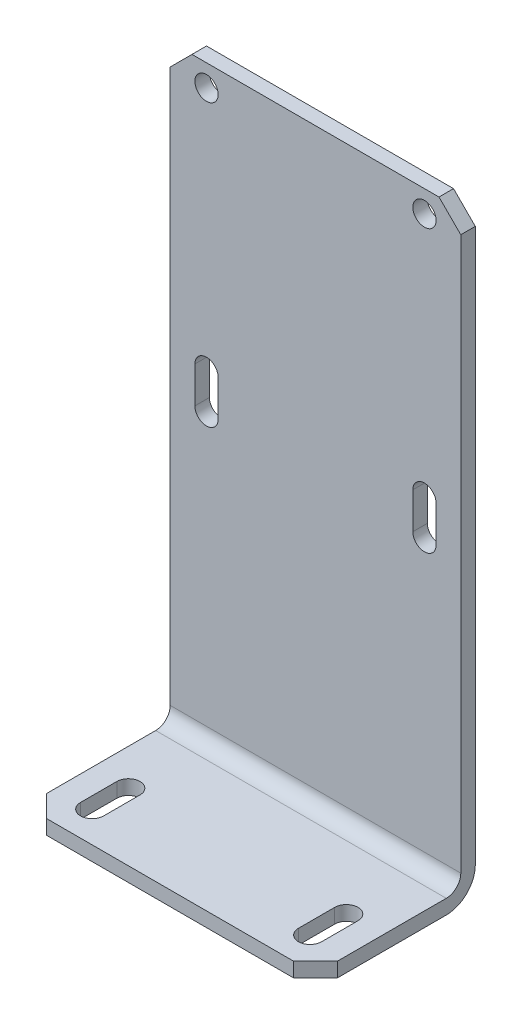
ISO-10303-21;
HEADER;
FILE_DESCRIPTION(('STEP AP214'),'2;1');
FILE_NAME('part.step','',(''),(''),'','','');
FILE_SCHEMA(('AUTOMOTIVE_DESIGN { 1 0 10303 214 1 1 1 1 }'));
ENDSEC;
DATA;
#1=APPLICATION_CONTEXT('core data for automotive mechanical design processes');
#2=APPLICATION_PROTOCOL_DEFINITION('international standard','automotive_design',2000,#1);
#3=PRODUCT_CONTEXT('',#1,'mechanical');
#4=PRODUCT('Part','Part','',(#3));
#5=PRODUCT_RELATED_PRODUCT_CATEGORY('part','',(#4));
#6=PRODUCT_DEFINITION_FORMATION('','',#4);
#7=PRODUCT_DEFINITION_CONTEXT('part definition',#1,'design');
#8=PRODUCT_DEFINITION('design','',#6,#7);
#9=PRODUCT_DEFINITION_SHAPE('','',#8);
#10=(LENGTH_UNIT() NAMED_UNIT(*) SI_UNIT(.MILLI.,.METRE.));
#11=(NAMED_UNIT(*) PLANE_ANGLE_UNIT() SI_UNIT($,.RADIAN.));
#12=(NAMED_UNIT(*) SI_UNIT($,.STERADIAN.) SOLID_ANGLE_UNIT());
#13=UNCERTAINTY_MEASURE_WITH_UNIT(LENGTH_MEASURE(1.E-05),#10,'distance_accuracy_value','');
#14=(GEOMETRIC_REPRESENTATION_CONTEXT(3) GLOBAL_UNCERTAINTY_ASSIGNED_CONTEXT((#13)) GLOBAL_UNIT_ASSIGNED_CONTEXT((#10,
#11,#12)) REPRESENTATION_CONTEXT('',''));
#15=CARTESIAN_POINT('',(0.,0.,0.));
#16=DIRECTION('',(0.,0.,1.));
#17=DIRECTION('',(1.,0.,0.));
#18=AXIS2_PLACEMENT_3D('',#15,#16,#17);
#19=CARTESIAN_POINT('',(0.,0.,2.));
#20=DIRECTION('',(0.,1.,0.));
#21=DIRECTION('',(0.,0.,1.));
#22=AXIS2_PLACEMENT_3D('',#19,#20,#21);
#23=PLANE('',#22);
#24=DIRECTION('',(0.,0.,-1.));
#25=VECTOR('',#24,1.);
#26=CARTESIAN_POINT('',(40.,1.2490009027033E-13,2.));
#27=LINE('',#26,#25);
#28=CARTESIAN_POINT('',(40.,1.2490009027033E-13,19.));
#29=VERTEX_POINT('',#28);
#30=CARTESIAN_POINT('',(40.,1.2490009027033E-13,4.));
#31=VERTEX_POINT('',#30);
#32=EDGE_CURVE('E444',#29,#31,#27,.T.);
#33=ORIENTED_EDGE('',*,*,#32,.F.);
#34=DIRECTION('',(-0.707106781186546,0.,0.707106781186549));
#35=VECTOR('',#34,1.);
#36=CARTESIAN_POINT('',(37.,1.2490009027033E-13,22.));
#37=LINE('',#36,#35);
#38=CARTESIAN_POINT('',(37.,1.2490009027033E-13,22.));
#39=VERTEX_POINT('',#38);
#40=EDGE_CURVE('E11',#29,#39,#37,.T.);
#41=ORIENTED_EDGE('',*,*,#40,.T.);
#42=DIRECTION('',(1.,0.,0.));
#43=VECTOR('',#42,1.);
#44=CARTESIAN_POINT('',(40.,1.2490009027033E-13,22.));
#45=LINE('',#44,#43);
#46=CARTESIAN_POINT('',(3.,1.2490009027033E-13,22.));
#47=VERTEX_POINT('',#46);
#48=EDGE_CURVE('E360',#47,#39,#45,.T.);
#49=ORIENTED_EDGE('',*,*,#48,.F.);
#50=DIRECTION('',(-0.707106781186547,0.,-0.707106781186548));
#51=VECTOR('',#50,1.);
#52=CARTESIAN_POINT('',(3.,1.2490009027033E-13,22.));
#53=LINE('',#52,#51);
#54=CARTESIAN_POINT('',(0.,1.2490009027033E-13,19.));
#55=VERTEX_POINT('',#54);
#56=EDGE_CURVE('E32',#47,#55,#53,.T.);
#57=ORIENTED_EDGE('',*,*,#56,.T.);
#58=DIRECTION('',(0.,0.,-1.));
#59=VECTOR('',#58,1.);
#60=CARTESIAN_POINT('',(0.,0.,2.));
#61=LINE('',#60,#59);
#62=CARTESIAN_POINT('',(0.,0.,4.));
#63=VERTEX_POINT('',#62);
#64=EDGE_CURVE('E414',#55,#63,#61,.T.);
#65=ORIENTED_EDGE('',*,*,#64,.T.);
#66=DIRECTION('',(1.,0.,0.));
#67=VECTOR('',#66,1.);
#68=CARTESIAN_POINT('',(40.,1.2490009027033E-13,4.));
#69=LINE('',#68,#67);
#70=EDGE_CURVE('E425',#63,#31,#69,.T.);
#71=ORIENTED_EDGE('',*,*,#70,.T.);
#72=EDGE_LOOP('',(#33,#41,#49,#57,#65,#71));
#73=FACE_BOUND('',#72,.T.);
#74=DIRECTION('',(0.,0.,1.));
#75=VECTOR('',#74,1.);
#76=CARTESIAN_POINT('',(3.39999999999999,1.2490009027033E-13,17.75));
#77=LINE('',#76,#75);
#78=CARTESIAN_POINT('',(3.39999999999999,1.2490009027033E-13,12.75));
#79=VERTEX_POINT('',#78);
#80=CARTESIAN_POINT('',(3.39999999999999,1.2490009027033E-13,17.75));
#81=VERTEX_POINT('',#80);
#82=EDGE_CURVE('E270',#79,#81,#77,.T.);
#83=ORIENTED_EDGE('',*,*,#82,.T.);
#84=CARTESIAN_POINT('',(4.99999999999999,1.2490009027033E-13,17.75));
#85=DIRECTION('',(0.,1.,0.));
#86=DIRECTION('',(-1.,0.,0.));
#87=AXIS2_PLACEMENT_3D('',#84,#85,#86);
#88=CIRCLE('',#87,1.6);
#89=CARTESIAN_POINT('',(6.59999999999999,1.2490009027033E-13,17.75));
#90=VERTEX_POINT('',#89);
#91=EDGE_CURVE('E261',#81,#90,#88,.T.);
#92=ORIENTED_EDGE('',*,*,#91,.T.);
#93=DIRECTION('',(0.,0.,-1.));
#94=VECTOR('',#93,1.);
#95=CARTESIAN_POINT('',(6.59999999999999,1.2490009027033E-13,17.75));
#96=LINE('',#95,#94);
#97=CARTESIAN_POINT('',(6.59999999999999,1.2490009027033E-13,12.75));
#98=VERTEX_POINT('',#97);
#99=EDGE_CURVE('E264',#90,#98,#96,.T.);
#100=ORIENTED_EDGE('',*,*,#99,.T.);
#101=CARTESIAN_POINT('',(4.99999999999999,1.2490009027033E-13,12.75));
#102=DIRECTION('',(0.,1.,0.));
#103=DIRECTION('',(-1.,0.,0.));
#104=AXIS2_PLACEMENT_3D('',#101,#102,#103);
#105=CIRCLE('',#104,1.6);
#106=EDGE_CURVE('E267',#98,#79,#105,.T.);
#107=ORIENTED_EDGE('',*,*,#106,.T.);
#108=EDGE_LOOP('',(#83,#92,#100,#107));
#109=FACE_BOUND('',#108,.T.);
#110=CARTESIAN_POINT('',(35.,1.2490009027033E-13,17.75));
#111=DIRECTION('',(0.,-1.,0.));
#112=DIRECTION('',(1.,0.,0.));
#113=AXIS2_PLACEMENT_3D('',#110,#111,#112);
#114=CIRCLE('',#113,1.6);
#115=CARTESIAN_POINT('',(36.6,1.2490009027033E-13,17.75));
#116=VERTEX_POINT('',#115);
#117=CARTESIAN_POINT('',(33.4,0.,17.75));
#118=VERTEX_POINT('',#117);
#119=EDGE_CURVE('E235',#116,#118,#114,.T.);
#120=ORIENTED_EDGE('',*,*,#119,.F.);
#121=DIRECTION('',(0.,0.,1.));
#122=VECTOR('',#121,1.);
#123=CARTESIAN_POINT('',(36.6,1.2490009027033E-13,17.75));
#124=LINE('',#123,#122);
#125=CARTESIAN_POINT('',(36.6,1.2490009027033E-13,12.75));
#126=VERTEX_POINT('',#125);
#127=EDGE_CURVE('E240',#126,#116,#124,.T.);
#128=ORIENTED_EDGE('',*,*,#127,.F.);
#129=CARTESIAN_POINT('',(35.,0.,12.75));
#130=DIRECTION('',(0.,-1.,0.));
#131=DIRECTION('',(1.,0.,0.));
#132=AXIS2_PLACEMENT_3D('',#129,#130,#131);
#133=CIRCLE('',#132,1.6);
#134=CARTESIAN_POINT('',(33.4,0.,12.75));
#135=VERTEX_POINT('',#134);
#136=EDGE_CURVE('E217',#135,#126,#133,.T.);
#137=ORIENTED_EDGE('',*,*,#136,.F.);
#138=DIRECTION('',(0.,0.,-1.));
#139=VECTOR('',#138,1.);
#140=CARTESIAN_POINT('',(33.4,0.,17.75));
#141=LINE('',#140,#139);
#142=EDGE_CURVE('E243',#118,#135,#141,.T.);
#143=ORIENTED_EDGE('',*,*,#142,.F.);
#144=EDGE_LOOP('',(#120,#128,#137,#143));
#145=FACE_BOUND('',#144,.T.);
#146=ADVANCED_FACE('F24',(#73,#109,#145),#23,.F.);
#147=CARTESIAN_POINT('',(40.,2.00000000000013,22.));
#148=DIRECTION('',(0.,-1.,0.));
#149=DIRECTION('',(1.,0.,0.));
#150=AXIS2_PLACEMENT_3D('',#147,#148,#149);
#151=PLANE('',#150);
#152=DIRECTION('',(-1.,0.,0.));
#153=VECTOR('',#152,1.);
#154=CARTESIAN_POINT('',(40.,2.00000000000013,22.));
#155=LINE('',#154,#153);
#156=CARTESIAN_POINT('',(37.,2.00000000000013,22.));
#157=VERTEX_POINT('',#156);
#158=CARTESIAN_POINT('',(3.,2.00000000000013,22.));
#159=VERTEX_POINT('',#158);
#160=EDGE_CURVE('E357',#157,#159,#155,.T.);
#161=ORIENTED_EDGE('',*,*,#160,.F.);
#162=DIRECTION('',(0.707106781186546,0.,-0.707106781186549));
#163=VECTOR('',#162,1.);
#164=CARTESIAN_POINT('',(37.,2.00000000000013,22.));
#165=LINE('',#164,#163);
#166=CARTESIAN_POINT('',(40.,2.00000000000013,19.));
#167=VERTEX_POINT('',#166);
#168=EDGE_CURVE('E479',#157,#167,#165,.T.);
#169=ORIENTED_EDGE('',*,*,#168,.T.);
#170=DIRECTION('',(0.,0.,-1.));
#171=VECTOR('',#170,1.);
#172=CARTESIAN_POINT('',(40.,2.00000000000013,22.));
#173=LINE('',#172,#171);
#174=CARTESIAN_POINT('',(40.,2.00000000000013,4.));
#175=VERTEX_POINT('',#174);
#176=EDGE_CURVE('E366',#167,#175,#173,.T.);
#177=ORIENTED_EDGE('',*,*,#176,.T.);
#178=DIRECTION('',(-1.,0.,0.));
#179=VECTOR('',#178,1.);
#180=CARTESIAN_POINT('',(0.,2.00000000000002,4.));
#181=LINE('',#180,#179);
#182=CARTESIAN_POINT('',(0.,2.00000000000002,4.));
#183=VERTEX_POINT('',#182);
#184=EDGE_CURVE('E410',#175,#183,#181,.T.);
#185=ORIENTED_EDGE('',*,*,#184,.T.);
#186=DIRECTION('',(0.,0.,-1.));
#187=VECTOR('',#186,1.);
#188=CARTESIAN_POINT('',(0.,2.00000000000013,22.));
#189=LINE('',#188,#187);
#190=CARTESIAN_POINT('',(0.,2.00000000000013,19.));
#191=VERTEX_POINT('',#190);
#192=EDGE_CURVE('E362',#191,#183,#189,.T.);
#193=ORIENTED_EDGE('',*,*,#192,.F.);
#194=DIRECTION('',(0.707106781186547,0.,0.707106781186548));
#195=VECTOR('',#194,1.);
#196=CARTESIAN_POINT('',(3.,2.00000000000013,22.));
#197=LINE('',#196,#195);
#198=EDGE_CURVE('E477',#191,#159,#197,.T.);
#199=ORIENTED_EDGE('',*,*,#198,.T.);
#200=EDGE_LOOP('',(#161,#169,#177,#185,#193,#199));
#201=FACE_BOUND('',#200,.T.);
#202=DIRECTION('',(0.,0.,-1.));
#203=VECTOR('',#202,1.);
#204=CARTESIAN_POINT('',(6.59999999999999,2.00000000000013,17.75));
#205=LINE('',#204,#203);
#206=CARTESIAN_POINT('',(6.59999999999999,2.00000000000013,17.75));
#207=VERTEX_POINT('',#206);
#208=CARTESIAN_POINT('',(6.59999999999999,2.00000000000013,12.75));
#209=VERTEX_POINT('',#208);
#210=EDGE_CURVE('E252',#207,#209,#205,.T.);
#211=ORIENTED_EDGE('',*,*,#210,.F.);
#212=CARTESIAN_POINT('',(4.99999999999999,2.00000000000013,17.75));
#213=DIRECTION('',(0.,1.,0.));
#214=DIRECTION('',(-1.,0.,0.));
#215=AXIS2_PLACEMENT_3D('',#212,#213,#214);
#216=CIRCLE('',#215,1.6);
#217=CARTESIAN_POINT('',(3.39999999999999,2.00000000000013,17.75));
#218=VERTEX_POINT('',#217);
#219=EDGE_CURVE('E248',#218,#207,#216,.T.);
#220=ORIENTED_EDGE('',*,*,#219,.F.);
#221=DIRECTION('',(0.,0.,1.));
#222=VECTOR('',#221,1.);
#223=CARTESIAN_POINT('',(3.39999999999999,2.00000000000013,17.75));
#224=LINE('',#223,#222);
#225=CARTESIAN_POINT('',(3.39999999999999,2.00000000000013,12.75));
#226=VERTEX_POINT('',#225);
#227=EDGE_CURVE('E258',#226,#218,#224,.T.);
#228=ORIENTED_EDGE('',*,*,#227,.F.);
#229=CARTESIAN_POINT('',(4.99999999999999,2.00000000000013,12.75));
#230=DIRECTION('',(0.,1.,0.));
#231=DIRECTION('',(-1.,0.,0.));
#232=AXIS2_PLACEMENT_3D('',#229,#230,#231);
#233=CIRCLE('',#232,1.6);
#234=EDGE_CURVE('E255',#209,#226,#233,.T.);
#235=ORIENTED_EDGE('',*,*,#234,.F.);
#236=EDGE_LOOP('',(#211,#220,#228,#235));
#237=FACE_BOUND('',#236,.T.);
#238=CARTESIAN_POINT('',(35.,2.00000000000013,17.75));
#239=DIRECTION('',(0.,-1.,0.));
#240=DIRECTION('',(1.,0.,0.));
#241=AXIS2_PLACEMENT_3D('',#238,#239,#240);
#242=CIRCLE('',#241,1.6);
#243=CARTESIAN_POINT('',(36.6,2.00000000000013,17.75));
#244=VERTEX_POINT('',#243);
#245=CARTESIAN_POINT('',(33.4,2.00000000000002,17.75));
#246=VERTEX_POINT('',#245);
#247=EDGE_CURVE('E230',#244,#246,#242,.T.);
#248=ORIENTED_EDGE('',*,*,#247,.T.);
#249=DIRECTION('',(0.,0.,-1.));
#250=VECTOR('',#249,1.);
#251=CARTESIAN_POINT('',(33.4,2.00000000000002,17.75));
#252=LINE('',#251,#250);
#253=CARTESIAN_POINT('',(33.4,2.00000000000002,12.75));
#254=VERTEX_POINT('',#253);
#255=EDGE_CURVE('E233',#246,#254,#252,.T.);
#256=ORIENTED_EDGE('',*,*,#255,.T.);
#257=CARTESIAN_POINT('',(35.,2.00000000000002,12.75));
#258=DIRECTION('',(0.,-1.,0.));
#259=DIRECTION('',(1.,0.,0.));
#260=AXIS2_PLACEMENT_3D('',#257,#258,#259);
#261=CIRCLE('',#260,1.6);
#262=CARTESIAN_POINT('',(36.6,2.00000000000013,12.75));
#263=VERTEX_POINT('',#262);
#264=EDGE_CURVE('E214',#254,#263,#261,.T.);
#265=ORIENTED_EDGE('',*,*,#264,.T.);
#266=DIRECTION('',(0.,0.,1.));
#267=VECTOR('',#266,1.);
#268=CARTESIAN_POINT('',(36.6,2.00000000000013,17.75));
#269=LINE('',#268,#267);
#270=EDGE_CURVE('E225',#263,#244,#269,.T.);
#271=ORIENTED_EDGE('',*,*,#270,.T.);
#272=EDGE_LOOP('',(#248,#256,#265,#271));
#273=FACE_BOUND('',#272,.T.);
#274=ADVANCED_FACE('F232',(#201,#237,#273),#151,.F.);
#275=CARTESIAN_POINT('',(0.,83.1,2.));
#276=DIRECTION('',(0.,0.,-1.));
#277=DIRECTION('',(-1.,0.,0.));
#278=AXIS2_PLACEMENT_3D('',#275,#276,#277);
#279=PLANE('',#278);
#280=CARTESIAN_POINT('',(34.9999999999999,80.1,2.));
#281=DIRECTION('',(0.,0.,-1.));
#282=DIRECTION('',(-1.,0.,0.));
#283=AXIS2_PLACEMENT_3D('',#280,#281,#282);
#284=CIRCLE('',#283,1.6);
#285=CARTESIAN_POINT('',(33.3999999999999,80.1,2.));
#286=VERTEX_POINT('',#285);
#287=EDGE_CURVE('E339',#286,#286,#284,.T.);
#288=ORIENTED_EDGE('',*,*,#287,.T.);
#289=EDGE_LOOP('',(#288));
#290=FACE_BOUND('',#289,.T.);
#291=CARTESIAN_POINT('',(4.99999999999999,80.1,2.));
#292=DIRECTION('',(0.,0.,1.));
#293=DIRECTION('',(1.,0.,0.));
#294=AXIS2_PLACEMENT_3D('',#291,#292,#293);
#295=CIRCLE('',#294,1.6);
#296=CARTESIAN_POINT('',(6.59999999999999,80.1,2.));
#297=VERTEX_POINT('',#296);
#298=EDGE_CURVE('E351',#297,#297,#295,.T.);
#299=ORIENTED_EDGE('',*,*,#298,.F.);
#300=EDGE_LOOP('',(#299));
#301=FACE_BOUND('',#300,.T.);
#302=DIRECTION('',(-1.,0.,0.));
#303=VECTOR('',#302,1.);
#304=CARTESIAN_POINT('',(0.,83.1,2.));
#305=LINE('',#304,#303);
#306=CARTESIAN_POINT('',(37.,83.1,2.));
#307=VERTEX_POINT('',#306);
#308=CARTESIAN_POINT('',(3.00000000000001,83.1,2.));
#309=VERTEX_POINT('',#308);
#310=EDGE_CURVE('E417',#307,#309,#305,.T.);
#311=ORIENTED_EDGE('',*,*,#310,.T.);
#312=DIRECTION('',(0.707106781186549,0.707106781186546,0.));
#313=VECTOR('',#312,1.);
#314=CARTESIAN_POINT('',(0.,80.1,2.));
#315=LINE('',#314,#313);
#316=CARTESIAN_POINT('',(0.,80.1,2.));
#317=VERTEX_POINT('',#316);
#318=EDGE_CURVE('E400',#309,#317,#315,.F.);
#319=ORIENTED_EDGE('',*,*,#318,.T.);
#320=DIRECTION('',(0.,-1.,0.));
#321=VECTOR('',#320,1.);
#322=CARTESIAN_POINT('',(0.,0.,2.));
#323=LINE('',#322,#321);
#324=CARTESIAN_POINT('',(0.,4.00000000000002,2.));
#325=VERTEX_POINT('',#324);
#326=EDGE_CURVE('E372',#317,#325,#323,.T.);
#327=ORIENTED_EDGE('',*,*,#326,.T.);
#328=DIRECTION('',(-1.,0.,0.));
#329=VECTOR('',#328,1.);
#330=CARTESIAN_POINT('',(40.,4.00000000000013,2.));
#331=LINE('',#330,#329);
#332=CARTESIAN_POINT('',(40.,4.00000000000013,2.));
#333=VERTEX_POINT('',#332);
#334=EDGE_CURVE('E413',#325,#333,#331,.F.);
#335=ORIENTED_EDGE('',*,*,#334,.T.);
#336=DIRECTION('',(0.,1.,0.));
#337=VECTOR('',#336,1.);
#338=CARTESIAN_POINT('',(40.,1.2490009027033E-13,2.));
#339=LINE('',#338,#337);
#340=CARTESIAN_POINT('',(39.9999999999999,80.1,2.));
#341=VERTEX_POINT('',#340);
#342=EDGE_CURVE('E380',#333,#341,#339,.T.);
#343=ORIENTED_EDGE('',*,*,#342,.T.);
#344=DIRECTION('',(0.707106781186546,-0.707106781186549,0.));
#345=VECTOR('',#344,1.);
#346=CARTESIAN_POINT('',(37.,83.1,2.));
#347=LINE('',#346,#345);
#348=EDGE_CURVE('E398',#341,#307,#347,.F.);
#349=ORIENTED_EDGE('',*,*,#348,.T.);
#350=EDGE_LOOP('',(#311,#319,#327,#335,#343,#349));
#351=FACE_BOUND('',#350,.T.);
#352=DIRECTION('',(0.,-1.,0.));
#353=VECTOR('',#352,1.);
#354=CARTESIAN_POINT('',(3.4,46.4000000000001,2.));
#355=LINE('',#354,#353);
#356=CARTESIAN_POINT('',(3.4,46.4000000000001,2.));
#357=VERTEX_POINT('',#356);
#358=CARTESIAN_POINT('',(3.39999999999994,41.4000000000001,2.));
#359=VERTEX_POINT('',#358);
#360=EDGE_CURVE('E315',#357,#359,#355,.T.);
#361=ORIENTED_EDGE('',*,*,#360,.F.);
#362=CARTESIAN_POINT('',(5.,46.4000000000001,2.));
#363=DIRECTION('',(0.,0.,1.));
#364=DIRECTION('',(1.,0.,0.));
#365=AXIS2_PLACEMENT_3D('',#362,#363,#364);
#366=CIRCLE('',#365,1.6);
#367=CARTESIAN_POINT('',(6.6,46.4000000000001,2.));
#368=VERTEX_POINT('',#367);
#369=EDGE_CURVE('E307',#368,#357,#366,.T.);
#370=ORIENTED_EDGE('',*,*,#369,.F.);
#371=DIRECTION('',(0.,1.,0.));
#372=VECTOR('',#371,1.);
#373=CARTESIAN_POINT('',(6.6,46.4000000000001,2.));
#374=LINE('',#373,#372);
#375=CARTESIAN_POINT('',(6.59999999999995,41.4000000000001,2.));
#376=VERTEX_POINT('',#375);
#377=EDGE_CURVE('E321',#376,#368,#374,.T.);
#378=ORIENTED_EDGE('',*,*,#377,.F.);
#379=CARTESIAN_POINT('',(4.99999999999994,41.4000000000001,2.));
#380=DIRECTION('',(0.,0.,1.));
#381=DIRECTION('',(-1.,0.,0.));
#382=AXIS2_PLACEMENT_3D('',#379,#380,#381);
#383=CIRCLE('',#382,1.6);
#384=EDGE_CURVE('E318',#359,#376,#383,.T.);
#385=ORIENTED_EDGE('',*,*,#384,.F.);
#386=EDGE_LOOP('',(#361,#370,#378,#385));
#387=FACE_BOUND('',#386,.T.);
#388=CARTESIAN_POINT('',(35.,46.4000000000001,2.));
#389=DIRECTION('',(0.,0.,-1.));
#390=DIRECTION('',(-1.,0.,0.));
#391=AXIS2_PLACEMENT_3D('',#388,#389,#390);
#392=CIRCLE('',#391,1.6);
#393=CARTESIAN_POINT('',(33.4,46.4,2.));
#394=VERTEX_POINT('',#393);
#395=CARTESIAN_POINT('',(36.6,46.4000000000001,2.));
#396=VERTEX_POINT('',#395);
#397=EDGE_CURVE('E276',#394,#396,#392,.T.);
#398=ORIENTED_EDGE('',*,*,#397,.T.);
#399=DIRECTION('',(0.,-1.,0.));
#400=VECTOR('',#399,1.);
#401=CARTESIAN_POINT('',(36.6,46.4000000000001,2.));
#402=LINE('',#401,#400);
#403=CARTESIAN_POINT('',(36.5999999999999,41.4000000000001,2.));
#404=VERTEX_POINT('',#403);
#405=EDGE_CURVE('E291',#396,#404,#402,.T.);
#406=ORIENTED_EDGE('',*,*,#405,.T.);
#407=CARTESIAN_POINT('',(34.9999999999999,41.4000000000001,2.));
#408=DIRECTION('',(0.,0.,-1.));
#409=DIRECTION('',(1.,0.,0.));
#410=AXIS2_PLACEMENT_3D('',#407,#408,#409);
#411=CIRCLE('',#410,1.6);
#412=CARTESIAN_POINT('',(33.3999999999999,41.4,2.));
#413=VERTEX_POINT('',#412);
#414=EDGE_CURVE('E288',#404,#413,#411,.T.);
#415=ORIENTED_EDGE('',*,*,#414,.T.);
#416=DIRECTION('',(0.,1.,0.));
#417=VECTOR('',#416,1.);
#418=CARTESIAN_POINT('',(33.4,46.4,2.));
#419=LINE('',#418,#417);
#420=EDGE_CURVE('E285',#413,#394,#419,.T.);
#421=ORIENTED_EDGE('',*,*,#420,.T.);
#422=EDGE_LOOP('',(#398,#406,#415,#421));
#423=FACE_BOUND('',#422,.T.);
#424=ADVANCED_FACE('F450',(#290,#301,#351,#387,#423),#279,.F.);
#425=CARTESIAN_POINT('',(0.,83.1,0.));
#426=DIRECTION('',(0.,0.,-1.));
#427=DIRECTION('',(-1.,0.,0.));
#428=AXIS2_PLACEMENT_3D('',#425,#426,#427);
#429=PLANE('',#428);
#430=CARTESIAN_POINT('',(34.9999999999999,80.1,0.));
#431=DIRECTION('',(0.,0.,-1.));
#432=DIRECTION('',(-1.,0.,0.));
#433=AXIS2_PLACEMENT_3D('',#430,#431,#432);
#434=CIRCLE('',#433,1.6);
#435=CARTESIAN_POINT('',(33.3999999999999,80.1,0.));
#436=VERTEX_POINT('',#435);
#437=EDGE_CURVE('E348',#436,#436,#434,.T.);
#438=ORIENTED_EDGE('',*,*,#437,.F.);
#439=EDGE_LOOP('',(#438));
#440=FACE_BOUND('',#439,.T.);
#441=CARTESIAN_POINT('',(4.99999999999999,80.1,0.));
#442=DIRECTION('',(0.,0.,1.));
#443=DIRECTION('',(1.,0.,0.));
#444=AXIS2_PLACEMENT_3D('',#441,#442,#443);
#445=CIRCLE('',#444,1.6);
#446=CARTESIAN_POINT('',(6.59999999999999,80.1,0.));
#447=VERTEX_POINT('',#446);
#448=EDGE_CURVE('E354',#447,#447,#445,.T.);
#449=ORIENTED_EDGE('',*,*,#448,.T.);
#450=EDGE_LOOP('',(#449));
#451=FACE_BOUND('',#450,.T.);
#452=DIRECTION('',(0.,-1.,0.));
#453=VECTOR('',#452,1.);
#454=CARTESIAN_POINT('',(0.,0.,0.));
#455=LINE('',#454,#453);
#456=CARTESIAN_POINT('',(0.,80.1,0.));
#457=VERTEX_POINT('',#456);
#458=CARTESIAN_POINT('',(0.,4.00000000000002,0.));
#459=VERTEX_POINT('',#458);
#460=EDGE_CURVE('E363',#457,#459,#455,.T.);
#461=ORIENTED_EDGE('',*,*,#460,.F.);
#462=DIRECTION('',(-0.707106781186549,-0.707106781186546,0.));
#463=VECTOR('',#462,1.);
#464=CARTESIAN_POINT('',(1.5,81.6,0.));
#465=LINE('',#464,#463);
#466=CARTESIAN_POINT('',(3.00000000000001,83.1,0.));
#467=VERTEX_POINT('',#466);
#468=EDGE_CURVE('E391',#457,#467,#465,.F.);
#469=ORIENTED_EDGE('',*,*,#468,.T.);
#470=DIRECTION('',(-1.,0.,0.));
#471=VECTOR('',#470,1.);
#472=CARTESIAN_POINT('',(0.,83.1,0.));
#473=LINE('',#472,#471);
#474=CARTESIAN_POINT('',(37.,83.1,0.));
#475=VERTEX_POINT('',#474);
#476=EDGE_CURVE('E369',#475,#467,#473,.T.);
#477=ORIENTED_EDGE('',*,*,#476,.F.);
#478=DIRECTION('',(-0.707106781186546,0.707106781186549,0.));
#479=VECTOR('',#478,1.);
#480=CARTESIAN_POINT('',(18.5,101.6,0.));
#481=LINE('',#480,#479);
#482=CARTESIAN_POINT('',(39.9999999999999,80.1,0.));
#483=VERTEX_POINT('',#482);
#484=EDGE_CURVE('E389',#475,#483,#481,.F.);
#485=ORIENTED_EDGE('',*,*,#484,.T.);
#486=DIRECTION('',(0.,1.,0.));
#487=VECTOR('',#486,1.);
#488=CARTESIAN_POINT('',(40.,1.2490009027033E-13,0.));
#489=LINE('',#488,#487);
#490=CARTESIAN_POINT('',(40.,4.00000000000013,0.));
#491=VERTEX_POINT('',#490);
#492=EDGE_CURVE('E365',#491,#483,#489,.T.);
#493=ORIENTED_EDGE('',*,*,#492,.F.);
#494=DIRECTION('',(1.,0.,0.));
#495=VECTOR('',#494,1.);
#496=CARTESIAN_POINT('',(0.,4.00000000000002,0.));
#497=LINE('',#496,#495);
#498=EDGE_CURVE('E430',#491,#459,#497,.F.);
#499=ORIENTED_EDGE('',*,*,#498,.T.);
#500=EDGE_LOOP('',(#461,#469,#477,#485,#493,#499));
#501=FACE_BOUND('',#500,.T.);
#502=CARTESIAN_POINT('',(5.,46.4000000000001,0.));
#503=DIRECTION('',(0.,0.,1.));
#504=DIRECTION('',(1.,0.,0.));
#505=AXIS2_PLACEMENT_3D('',#502,#503,#504);
#506=CIRCLE('',#505,1.6);
#507=CARTESIAN_POINT('',(6.6,46.4000000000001,0.));
#508=VERTEX_POINT('',#507);
#509=CARTESIAN_POINT('',(3.4,46.4000000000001,0.));
#510=VERTEX_POINT('',#509);
#511=EDGE_CURVE('E324',#508,#510,#506,.T.);
#512=ORIENTED_EDGE('',*,*,#511,.T.);
#513=DIRECTION('',(0.,-1.,0.));
#514=VECTOR('',#513,1.);
#515=CARTESIAN_POINT('',(3.4,46.4000000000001,0.));
#516=LINE('',#515,#514);
#517=CARTESIAN_POINT('',(3.39999999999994,41.4000000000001,0.));
#518=VERTEX_POINT('',#517);
#519=EDGE_CURVE('E327',#510,#518,#516,.T.);
#520=ORIENTED_EDGE('',*,*,#519,.T.);
#521=CARTESIAN_POINT('',(4.99999999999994,41.4000000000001,0.));
#522=DIRECTION('',(0.,0.,1.));
#523=DIRECTION('',(-1.,0.,0.));
#524=AXIS2_PLACEMENT_3D('',#521,#522,#523);
#525=CIRCLE('',#524,1.6);
#526=CARTESIAN_POINT('',(6.59999999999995,41.4000000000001,0.));
#527=VERTEX_POINT('',#526);
#528=EDGE_CURVE('E330',#518,#527,#525,.T.);
#529=ORIENTED_EDGE('',*,*,#528,.T.);
#530=DIRECTION('',(0.,1.,0.));
#531=VECTOR('',#530,1.);
#532=CARTESIAN_POINT('',(6.6,46.4000000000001,0.));
#533=LINE('',#532,#531);
#534=EDGE_CURVE('E333',#527,#508,#533,.T.);
#535=ORIENTED_EDGE('',*,*,#534,.T.);
#536=EDGE_LOOP('',(#512,#520,#529,#535));
#537=FACE_BOUND('',#536,.T.);
#538=DIRECTION('',(0.,-1.,0.));
#539=VECTOR('',#538,1.);
#540=CARTESIAN_POINT('',(36.6,46.4000000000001,0.));
#541=LINE('',#540,#539);
#542=CARTESIAN_POINT('',(36.6,46.4000000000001,0.));
#543=VERTEX_POINT('',#542);
#544=CARTESIAN_POINT('',(36.5999999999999,41.4000000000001,0.));
#545=VERTEX_POINT('',#544);
#546=EDGE_CURVE('E301',#543,#545,#541,.T.);
#547=ORIENTED_EDGE('',*,*,#546,.F.);
#548=CARTESIAN_POINT('',(35.,46.4,0.));
#549=DIRECTION('',(0.,0.,-1.));
#550=DIRECTION('',(-1.,0.,0.));
#551=AXIS2_PLACEMENT_3D('',#548,#549,#550);
#552=CIRCLE('',#551,1.6);
#553=CARTESIAN_POINT('',(33.4,46.4,0.));
#554=VERTEX_POINT('',#553);
#555=EDGE_CURVE('E294',#554,#543,#552,.T.);
#556=ORIENTED_EDGE('',*,*,#555,.F.);
#557=DIRECTION('',(0.,1.,0.));
#558=VECTOR('',#557,1.);
#559=CARTESIAN_POINT('',(33.4,46.4,0.));
#560=LINE('',#559,#558);
#561=CARTESIAN_POINT('',(33.3999999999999,41.4,0.));
#562=VERTEX_POINT('',#561);
#563=EDGE_CURVE('E296',#562,#554,#560,.T.);
#564=ORIENTED_EDGE('',*,*,#563,.F.);
#565=CARTESIAN_POINT('',(34.9999999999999,41.4,0.));
#566=DIRECTION('',(0.,0.,-1.));
#567=DIRECTION('',(1.,0.,0.));
#568=AXIS2_PLACEMENT_3D('',#565,#566,#567);
#569=CIRCLE('',#568,1.6);
#570=EDGE_CURVE('E298',#545,#562,#569,.T.);
#571=ORIENTED_EDGE('',*,*,#570,.F.);
#572=EDGE_LOOP('',(#547,#556,#564,#571));
#573=FACE_BOUND('',#572,.T.);
#574=ADVANCED_FACE('F460',(#440,#451,#501,#537,#573),#429,.T.);
#575=CARTESIAN_POINT('',(0.,0.,2.));
#576=DIRECTION('',(1.,0.,0.));
#577=DIRECTION('',(0.,0.,-1.));
#578=AXIS2_PLACEMENT_3D('',#575,#576,#577);
#579=PLANE('',#578);
#580=ORIENTED_EDGE('',*,*,#326,.F.);
#581=DIRECTION('',(0.,0.,-1.));
#582=VECTOR('',#581,1.);
#583=CARTESIAN_POINT('',(0.,80.1,2.));
#584=LINE('',#583,#582);
#585=EDGE_CURVE('E385',#317,#457,#584,.T.);
#586=ORIENTED_EDGE('',*,*,#585,.T.);
#587=ORIENTED_EDGE('',*,*,#460,.T.);
#588=CARTESIAN_POINT('',(0.,4.00000000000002,4.));
#589=DIRECTION('',(1.,0.,0.));
#590=DIRECTION('',(0.,0.,-1.));
#591=AXIS2_PLACEMENT_3D('',#588,#589,#590);
#592=CIRCLE('',#591,4.);
#593=EDGE_CURVE('E386',#459,#63,#592,.F.);
#594=ORIENTED_EDGE('',*,*,#593,.T.);
#595=ORIENTED_EDGE('',*,*,#64,.F.);
#596=DIRECTION('',(0.,1.,0.));
#597=VECTOR('',#596,1.);
#598=CARTESIAN_POINT('',(0.,2.00000000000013,19.));
#599=LINE('',#598,#597);
#600=EDGE_CURVE('E383',#55,#191,#599,.T.);
#601=ORIENTED_EDGE('',*,*,#600,.T.);
#602=ORIENTED_EDGE('',*,*,#192,.T.);
#603=CARTESIAN_POINT('',(0.,4.00000000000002,4.));
#604=DIRECTION('',(1.,0.,0.));
#605=DIRECTION('',(0.,0.,-1.));
#606=AXIS2_PLACEMENT_3D('',#603,#604,#605);
#607=CIRCLE('',#606,2.);
#608=EDGE_CURVE('E419',#183,#325,#607,.T.);
#609=ORIENTED_EDGE('',*,*,#608,.T.);
#610=EDGE_LOOP('',(#580,#586,#587,#594,#595,#601,#602,#609));
#611=FACE_BOUND('',#610,.T.);
#612=ADVANCED_FACE('F26',(#611),#579,.F.);
#613=CARTESIAN_POINT('',(40.,1.2490009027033E-13,2.));
#614=DIRECTION('',(-1.,0.,0.));
#615=DIRECTION('',(0.,0.,1.));
#616=AXIS2_PLACEMENT_3D('',#613,#614,#615);
#617=PLANE('',#616);
#618=ORIENTED_EDGE('',*,*,#492,.T.);
#619=DIRECTION('',(0.,0.,1.));
#620=VECTOR('',#619,1.);
#621=CARTESIAN_POINT('',(39.9999999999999,80.1,2.));
#622=LINE('',#621,#620);
#623=EDGE_CURVE('E468',#483,#341,#622,.T.);
#624=ORIENTED_EDGE('',*,*,#623,.T.);
#625=ORIENTED_EDGE('',*,*,#342,.F.);
#626=CARTESIAN_POINT('',(40.,4.00000000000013,4.));
#627=DIRECTION('',(-1.,0.,0.));
#628=DIRECTION('',(0.,0.,1.));
#629=AXIS2_PLACEMENT_3D('',#626,#627,#628);
#630=CIRCLE('',#629,2.);
#631=EDGE_CURVE('E422',#333,#175,#630,.T.);
#632=ORIENTED_EDGE('',*,*,#631,.T.);
#633=ORIENTED_EDGE('',*,*,#176,.F.);
#634=DIRECTION('',(0.,-1.,0.));
#635=VECTOR('',#634,1.);
#636=CARTESIAN_POINT('',(40.,1.2490009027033E-13,19.));
#637=LINE('',#636,#635);
#638=EDGE_CURVE('E402',#167,#29,#637,.T.);
#639=ORIENTED_EDGE('',*,*,#638,.T.);
#640=ORIENTED_EDGE('',*,*,#32,.T.);
#641=CARTESIAN_POINT('',(40.,4.00000000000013,4.));
#642=DIRECTION('',(-1.,0.,0.));
#643=DIRECTION('',(0.,0.,1.));
#644=AXIS2_PLACEMENT_3D('',#641,#642,#643);
#645=CIRCLE('',#644,4.);
#646=EDGE_CURVE('E428',#31,#491,#645,.F.);
#647=ORIENTED_EDGE('',*,*,#646,.T.);
#648=EDGE_LOOP('',(#618,#624,#625,#632,#633,#639,#640,#647));
#649=FACE_BOUND('',#648,.T.);
#650=ADVANCED_FACE('F466',(#649),#617,.F.);
#651=CARTESIAN_POINT('',(0.,83.1,2.));
#652=DIRECTION('',(0.,-1.,0.));
#653=DIRECTION('',(0.,0.,-1.));
#654=AXIS2_PLACEMENT_3D('',#651,#652,#653);
#655=PLANE('',#654);
#656=ORIENTED_EDGE('',*,*,#476,.T.);
#657=DIRECTION('',(0.,0.,1.));
#658=VECTOR('',#657,1.);
#659=CARTESIAN_POINT('',(3.00000000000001,83.1,2.));
#660=LINE('',#659,#658);
#661=EDGE_CURVE('E396',#467,#309,#660,.T.);
#662=ORIENTED_EDGE('',*,*,#661,.T.);
#663=ORIENTED_EDGE('',*,*,#310,.F.);
#664=DIRECTION('',(0.,0.,-1.));
#665=VECTOR('',#664,1.);
#666=CARTESIAN_POINT('',(37.,83.1,2.));
#667=LINE('',#666,#665);
#668=EDGE_CURVE('E393',#307,#475,#667,.T.);
#669=ORIENTED_EDGE('',*,*,#668,.T.);
#670=EDGE_LOOP('',(#656,#662,#663,#669));
#671=FACE_BOUND('',#670,.T.);
#672=ADVANCED_FACE('F508',(#671),#655,.F.);
#673=CARTESIAN_POINT('',(40.,1.2490009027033E-13,22.));
#674=DIRECTION('',(0.,0.,1.));
#675=DIRECTION('',(1.,0.,0.));
#676=AXIS2_PLACEMENT_3D('',#673,#674,#675);
#677=PLANE('',#676);
#678=ORIENTED_EDGE('',*,*,#48,.T.);
#679=DIRECTION('',(0.,1.,0.));
#680=VECTOR('',#679,1.);
#681=CARTESIAN_POINT('',(37.,2.00000000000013,22.));
#682=LINE('',#681,#680);
#683=EDGE_CURVE('E472',#39,#157,#682,.T.);
#684=ORIENTED_EDGE('',*,*,#683,.T.);
#685=ORIENTED_EDGE('',*,*,#160,.T.);
#686=DIRECTION('',(0.,-1.,0.));
#687=VECTOR('',#686,1.);
#688=CARTESIAN_POINT('',(3.,1.2490009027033E-13,22.));
#689=LINE('',#688,#687);
#690=EDGE_CURVE('E471',#159,#47,#689,.T.);
#691=ORIENTED_EDGE('',*,*,#690,.T.);
#692=EDGE_LOOP('',(#678,#684,#685,#691));
#693=FACE_BOUND('',#692,.T.);
#694=ADVANCED_FACE('F491',(#693),#677,.T.);
#695=CARTESIAN_POINT('',(40.,4.00000000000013,4.));
#696=DIRECTION('',(1.,0.,0.));
#697=DIRECTION('',(0.,1.,0.));
#698=AXIS2_PLACEMENT_3D('',#695,#696,#697);
#699=CYLINDRICAL_SURFACE('',#698,2.);
#700=ORIENTED_EDGE('',*,*,#631,.F.);
#701=ORIENTED_EDGE('',*,*,#334,.F.);
#702=ORIENTED_EDGE('',*,*,#608,.F.);
#703=ORIENTED_EDGE('',*,*,#184,.F.);
#704=EDGE_LOOP('',(#700,#701,#702,#703));
#705=FACE_BOUND('',#704,.T.);
#706=ADVANCED_FACE('F498',(#705),#699,.F.);
#707=CARTESIAN_POINT('',(0.,4.00000000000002,4.));
#708=DIRECTION('',(-1.,0.,0.));
#709=DIRECTION('',(0.,0.,1.));
#710=AXIS2_PLACEMENT_3D('',#707,#708,#709);
#711=CYLINDRICAL_SURFACE('',#710,4.);
#712=ORIENTED_EDGE('',*,*,#593,.F.);
#713=ORIENTED_EDGE('',*,*,#498,.F.);
#714=ORIENTED_EDGE('',*,*,#646,.F.);
#715=ORIENTED_EDGE('',*,*,#70,.F.);
#716=EDGE_LOOP('',(#712,#713,#714,#715));
#717=FACE_BOUND('',#716,.T.);
#718=ADVANCED_FACE('F442',(#717),#711,.T.);
#719=CARTESIAN_POINT('',(4.99999999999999,80.1,0.));
#720=DIRECTION('',(0.,0.,1.));
#721=DIRECTION('',(1.,0.,0.));
#722=AXIS2_PLACEMENT_3D('',#719,#720,#721);
#723=CYLINDRICAL_SURFACE('',#722,1.6);
#724=ORIENTED_EDGE('',*,*,#448,.F.);
#725=EDGE_LOOP('',(#724));
#726=FACE_BOUND('',#725,.T.);
#727=ORIENTED_EDGE('',*,*,#298,.T.);
#728=EDGE_LOOP('',(#727));
#729=FACE_BOUND('',#728,.T.);
#730=ADVANCED_FACE('F506',(#726,#729),#723,.F.);
#731=CARTESIAN_POINT('',(34.9999999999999,80.1,0.));
#732=DIRECTION('',(0.,0.,1.));
#733=DIRECTION('',(1.,0.,0.));
#734=AXIS2_PLACEMENT_3D('',#731,#732,#733);
#735=CYLINDRICAL_SURFACE('',#734,1.6);
#736=ORIENTED_EDGE('',*,*,#437,.T.);
#737=EDGE_LOOP('',(#736));
#738=FACE_BOUND('',#737,.T.);
#739=ORIENTED_EDGE('',*,*,#287,.F.);
#740=EDGE_LOOP('',(#739));
#741=FACE_BOUND('',#740,.T.);
#742=ADVANCED_FACE('F535',(#738,#741),#735,.F.);
#743=CARTESIAN_POINT('',(5.,46.4000000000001,0.));
#744=DIRECTION('',(0.,0.,1.));
#745=DIRECTION('',(1.,0.,0.));
#746=AXIS2_PLACEMENT_3D('',#743,#744,#745);
#747=CYLINDRICAL_SURFACE('',#746,1.6);
#748=ORIENTED_EDGE('',*,*,#369,.T.);
#749=DIRECTION('',(0.,0.,1.));
#750=VECTOR('',#749,1.);
#751=CARTESIAN_POINT('',(3.4,46.4000000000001,0.));
#752=LINE('',#751,#750);
#753=EDGE_CURVE('E336',#510,#357,#752,.T.);
#754=ORIENTED_EDGE('',*,*,#753,.F.);
#755=ORIENTED_EDGE('',*,*,#511,.F.);
#756=DIRECTION('',(0.,0.,1.));
#757=VECTOR('',#756,1.);
#758=CARTESIAN_POINT('',(6.6,46.4000000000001,0.));
#759=LINE('',#758,#757);
#760=EDGE_CURVE('E337',#508,#368,#759,.T.);
#761=ORIENTED_EDGE('',*,*,#760,.T.);
#762=EDGE_LOOP('',(#748,#754,#755,#761));
#763=FACE_BOUND('',#762,.T.);
#764=ADVANCED_FACE('F542',(#763),#747,.F.);
#765=CARTESIAN_POINT('',(6.6,46.4000000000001,0.));
#766=DIRECTION('',(1.,0.,0.));
#767=DIRECTION('',(0.,1.,0.));
#768=AXIS2_PLACEMENT_3D('',#765,#766,#767);
#769=PLANE('',#768);
#770=ORIENTED_EDGE('',*,*,#377,.T.);
#771=ORIENTED_EDGE('',*,*,#760,.F.);
#772=ORIENTED_EDGE('',*,*,#534,.F.);
#773=DIRECTION('',(0.,0.,1.));
#774=VECTOR('',#773,1.);
#775=CARTESIAN_POINT('',(6.59999999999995,41.4000000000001,0.));
#776=LINE('',#775,#774);
#777=EDGE_CURVE('E340',#527,#376,#776,.T.);
#778=ORIENTED_EDGE('',*,*,#777,.T.);
#779=EDGE_LOOP('',(#770,#771,#772,#778));
#780=FACE_BOUND('',#779,.T.);
#781=ADVANCED_FACE('F548',(#780),#769,.F.);
#782=CARTESIAN_POINT('',(4.99999999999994,41.4000000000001,0.));
#783=DIRECTION('',(0.,0.,1.));
#784=DIRECTION('',(1.,0.,0.));
#785=AXIS2_PLACEMENT_3D('',#782,#783,#784);
#786=CYLINDRICAL_SURFACE('',#785,1.6);
#787=ORIENTED_EDGE('',*,*,#384,.T.);
#788=ORIENTED_EDGE('',*,*,#777,.F.);
#789=ORIENTED_EDGE('',*,*,#528,.F.);
#790=DIRECTION('',(0.,0.,1.));
#791=VECTOR('',#790,1.);
#792=CARTESIAN_POINT('',(3.39999999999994,41.4000000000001,0.));
#793=LINE('',#792,#791);
#794=EDGE_CURVE('E342',#518,#359,#793,.T.);
#795=ORIENTED_EDGE('',*,*,#794,.T.);
#796=EDGE_LOOP('',(#787,#788,#789,#795));
#797=FACE_BOUND('',#796,.T.);
#798=ADVANCED_FACE('F554',(#797),#786,.F.);
#799=CARTESIAN_POINT('',(3.4,46.4000000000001,0.));
#800=DIRECTION('',(-1.,0.,0.));
#801=DIRECTION('',(0.,-1.,0.));
#802=AXIS2_PLACEMENT_3D('',#799,#800,#801);
#803=PLANE('',#802);
#804=ORIENTED_EDGE('',*,*,#360,.T.);
#805=ORIENTED_EDGE('',*,*,#794,.F.);
#806=ORIENTED_EDGE('',*,*,#519,.F.);
#807=ORIENTED_EDGE('',*,*,#753,.T.);
#808=EDGE_LOOP('',(#804,#805,#806,#807));
#809=FACE_BOUND('',#808,.T.);
#810=ADVANCED_FACE('F550',(#809),#803,.F.);
#811=CARTESIAN_POINT('',(35.,46.4,0.));
#812=DIRECTION('',(0.,0.,1.));
#813=DIRECTION('',(1.,0.,0.));
#814=AXIS2_PLACEMENT_3D('',#811,#812,#813);
#815=CYLINDRICAL_SURFACE('',#814,1.6);
#816=ORIENTED_EDGE('',*,*,#397,.F.);
#817=DIRECTION('',(0.,0.,1.));
#818=VECTOR('',#817,1.);
#819=CARTESIAN_POINT('',(33.4,46.4,0.));
#820=LINE('',#819,#818);
#821=EDGE_CURVE('E303',#554,#394,#820,.T.);
#822=ORIENTED_EDGE('',*,*,#821,.F.);
#823=ORIENTED_EDGE('',*,*,#555,.T.);
#824=DIRECTION('',(0.,0.,1.));
#825=VECTOR('',#824,1.);
#826=CARTESIAN_POINT('',(36.6,46.4000000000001,0.));
#827=LINE('',#826,#825);
#828=EDGE_CURVE('E304',#543,#396,#827,.T.);
#829=ORIENTED_EDGE('',*,*,#828,.T.);
#830=EDGE_LOOP('',(#816,#822,#823,#829));
#831=FACE_BOUND('',#830,.T.);
#832=ADVANCED_FACE('F553',(#831),#815,.F.);
#833=CARTESIAN_POINT('',(36.6,46.4000000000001,0.));
#834=DIRECTION('',(-1.,0.,0.));
#835=DIRECTION('',(0.,-1.,0.));
#836=AXIS2_PLACEMENT_3D('',#833,#834,#835);
#837=PLANE('',#836);
#838=ORIENTED_EDGE('',*,*,#405,.F.);
#839=ORIENTED_EDGE('',*,*,#828,.F.);
#840=ORIENTED_EDGE('',*,*,#546,.T.);
#841=DIRECTION('',(0.,0.,1.));
#842=VECTOR('',#841,1.);
#843=CARTESIAN_POINT('',(36.5999999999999,41.4000000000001,0.));
#844=LINE('',#843,#842);
#845=EDGE_CURVE('E308',#545,#404,#844,.T.);
#846=ORIENTED_EDGE('',*,*,#845,.T.);
#847=EDGE_LOOP('',(#838,#839,#840,#846));
#848=FACE_BOUND('',#847,.T.);
#849=ADVANCED_FACE('F564',(#848),#837,.T.);
#850=CARTESIAN_POINT('',(34.9999999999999,41.4,0.));
#851=DIRECTION('',(0.,0.,1.));
#852=DIRECTION('',(1.,0.,0.));
#853=AXIS2_PLACEMENT_3D('',#850,#851,#852);
#854=CYLINDRICAL_SURFACE('',#853,1.6);
#855=ORIENTED_EDGE('',*,*,#414,.F.);
#856=ORIENTED_EDGE('',*,*,#845,.F.);
#857=ORIENTED_EDGE('',*,*,#570,.T.);
#858=DIRECTION('',(0.,0.,1.));
#859=VECTOR('',#858,1.);
#860=CARTESIAN_POINT('',(33.3999999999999,41.4,0.));
#861=LINE('',#860,#859);
#862=EDGE_CURVE('E310',#562,#413,#861,.T.);
#863=ORIENTED_EDGE('',*,*,#862,.T.);
#864=EDGE_LOOP('',(#855,#856,#857,#863));
#865=FACE_BOUND('',#864,.T.);
#866=ADVANCED_FACE('F570',(#865),#854,.F.);
#867=CARTESIAN_POINT('',(33.4,46.4,0.));
#868=DIRECTION('',(1.,0.,0.));
#869=DIRECTION('',(0.,1.,0.));
#870=AXIS2_PLACEMENT_3D('',#867,#868,#869);
#871=PLANE('',#870);
#872=ORIENTED_EDGE('',*,*,#420,.F.);
#873=ORIENTED_EDGE('',*,*,#862,.F.);
#874=ORIENTED_EDGE('',*,*,#563,.T.);
#875=ORIENTED_EDGE('',*,*,#821,.T.);
#876=EDGE_LOOP('',(#872,#873,#874,#875));
#877=FACE_BOUND('',#876,.T.);
#878=ADVANCED_FACE('F566',(#877),#871,.T.);
#879=CARTESIAN_POINT('',(4.99999999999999,1.2490009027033E-13,17.75));
#880=DIRECTION('',(0.,1.,0.));
#881=DIRECTION('',(-1.,0.,0.));
#882=AXIS2_PLACEMENT_3D('',#879,#880,#881);
#883=CYLINDRICAL_SURFACE('',#882,1.6);
#884=ORIENTED_EDGE('',*,*,#219,.T.);
#885=DIRECTION('',(0.,1.,0.));
#886=VECTOR('',#885,1.);
#887=CARTESIAN_POINT('',(6.59999999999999,1.2490009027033E-13,17.75));
#888=LINE('',#887,#886);
#889=EDGE_CURVE('E273',#90,#207,#888,.T.);
#890=ORIENTED_EDGE('',*,*,#889,.F.);
#891=ORIENTED_EDGE('',*,*,#91,.F.);
#892=DIRECTION('',(0.,1.,0.));
#893=VECTOR('',#892,1.);
#894=CARTESIAN_POINT('',(3.39999999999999,1.2490009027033E-13,17.75));
#895=LINE('',#894,#893);
#896=EDGE_CURVE('E274',#81,#218,#895,.T.);
#897=ORIENTED_EDGE('',*,*,#896,.T.);
#898=EDGE_LOOP('',(#884,#890,#891,#897));
#899=FACE_BOUND('',#898,.T.);
#900=ADVANCED_FACE('F569',(#899),#883,.F.);
#901=CARTESIAN_POINT('',(3.39999999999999,1.2490009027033E-13,17.75));
#902=DIRECTION('',(-1.,0.,0.));
#903=DIRECTION('',(0.,0.,1.));
#904=AXIS2_PLACEMENT_3D('',#901,#902,#903);
#905=PLANE('',#904);
#906=ORIENTED_EDGE('',*,*,#227,.T.);
#907=ORIENTED_EDGE('',*,*,#896,.F.);
#908=ORIENTED_EDGE('',*,*,#82,.F.);
#909=DIRECTION('',(0.,1.,0.));
#910=VECTOR('',#909,1.);
#911=CARTESIAN_POINT('',(3.39999999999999,1.2490009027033E-13,12.75));
#912=LINE('',#911,#910);
#913=EDGE_CURVE('E277',#79,#226,#912,.T.);
#914=ORIENTED_EDGE('',*,*,#913,.T.);
#915=EDGE_LOOP('',(#906,#907,#908,#914));
#916=FACE_BOUND('',#915,.T.);
#917=ADVANCED_FACE('F580',(#916),#905,.F.);
#918=CARTESIAN_POINT('',(4.99999999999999,1.2490009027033E-13,12.75));
#919=DIRECTION('',(0.,1.,0.));
#920=DIRECTION('',(-1.,0.,0.));
#921=AXIS2_PLACEMENT_3D('',#918,#919,#920);
#922=CYLINDRICAL_SURFACE('',#921,1.6);
#923=ORIENTED_EDGE('',*,*,#234,.T.);
#924=ORIENTED_EDGE('',*,*,#913,.F.);
#925=ORIENTED_EDGE('',*,*,#106,.F.);
#926=DIRECTION('',(0.,1.,0.));
#927=VECTOR('',#926,1.);
#928=CARTESIAN_POINT('',(6.59999999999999,1.2490009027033E-13,12.75));
#929=LINE('',#928,#927);
#930=EDGE_CURVE('E279',#98,#209,#929,.T.);
#931=ORIENTED_EDGE('',*,*,#930,.T.);
#932=EDGE_LOOP('',(#923,#924,#925,#931));
#933=FACE_BOUND('',#932,.T.);
#934=ADVANCED_FACE('F586',(#933),#922,.F.);
#935=CARTESIAN_POINT('',(6.59999999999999,1.2490009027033E-13,17.75));
#936=DIRECTION('',(1.,0.,0.));
#937=DIRECTION('',(0.,0.,-1.));
#938=AXIS2_PLACEMENT_3D('',#935,#936,#937);
#939=PLANE('',#938);
#940=ORIENTED_EDGE('',*,*,#210,.T.);
#941=ORIENTED_EDGE('',*,*,#930,.F.);
#942=ORIENTED_EDGE('',*,*,#99,.F.);
#943=ORIENTED_EDGE('',*,*,#889,.T.);
#944=EDGE_LOOP('',(#940,#941,#942,#943));
#945=FACE_BOUND('',#944,.T.);
#946=ADVANCED_FACE('F582',(#945),#939,.F.);
#947=CARTESIAN_POINT('',(35.,1.2490009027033E-13,17.75));
#948=DIRECTION('',(0.,1.,0.));
#949=DIRECTION('',(-1.,0.,0.));
#950=AXIS2_PLACEMENT_3D('',#947,#948,#949);
#951=CYLINDRICAL_SURFACE('',#950,1.6);
#952=ORIENTED_EDGE('',*,*,#247,.F.);
#953=DIRECTION('',(0.,1.,0.));
#954=VECTOR('',#953,1.);
#955=CARTESIAN_POINT('',(36.6,1.2490009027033E-13,17.75));
#956=LINE('',#955,#954);
#957=EDGE_CURVE('E221',#116,#244,#956,.T.);
#958=ORIENTED_EDGE('',*,*,#957,.F.);
#959=ORIENTED_EDGE('',*,*,#119,.T.);
#960=DIRECTION('',(0.,1.,0.));
#961=VECTOR('',#960,1.);
#962=CARTESIAN_POINT('',(33.4,0.,17.75));
#963=LINE('',#962,#961);
#964=EDGE_CURVE('E245',#118,#246,#963,.T.);
#965=ORIENTED_EDGE('',*,*,#964,.T.);
#966=EDGE_LOOP('',(#952,#958,#959,#965));
#967=FACE_BOUND('',#966,.T.);
#968=ADVANCED_FACE('F585',(#967),#951,.F.);
#969=CARTESIAN_POINT('',(33.4,0.,17.75));
#970=DIRECTION('',(1.,0.,0.));
#971=DIRECTION('',(0.,0.,-1.));
#972=AXIS2_PLACEMENT_3D('',#969,#970,#971);
#973=PLANE('',#972);
#974=ORIENTED_EDGE('',*,*,#255,.F.);
#975=ORIENTED_EDGE('',*,*,#964,.F.);
#976=ORIENTED_EDGE('',*,*,#142,.T.);
#977=DIRECTION('',(0.,1.,0.));
#978=VECTOR('',#977,1.);
#979=CARTESIAN_POINT('',(33.4,0.,12.75));
#980=LINE('',#979,#978);
#981=EDGE_CURVE('E220',#135,#254,#980,.T.);
#982=ORIENTED_EDGE('',*,*,#981,.T.);
#983=EDGE_LOOP('',(#974,#975,#976,#982));
#984=FACE_BOUND('',#983,.T.);
#985=ADVANCED_FACE('F596',(#984),#973,.T.);
#986=CARTESIAN_POINT('',(35.,0.,12.75));
#987=DIRECTION('',(0.,1.,0.));
#988=DIRECTION('',(-1.,0.,0.));
#989=AXIS2_PLACEMENT_3D('',#986,#987,#988);
#990=CYLINDRICAL_SURFACE('',#989,1.6);
#991=ORIENTED_EDGE('',*,*,#264,.F.);
#992=ORIENTED_EDGE('',*,*,#981,.F.);
#993=ORIENTED_EDGE('',*,*,#136,.T.);
#994=DIRECTION('',(0.,1.,0.));
#995=VECTOR('',#994,1.);
#996=CARTESIAN_POINT('',(36.6,1.2490009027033E-13,12.75));
#997=LINE('',#996,#995);
#998=EDGE_CURVE('E209',#126,#263,#997,.T.);
#999=ORIENTED_EDGE('',*,*,#998,.T.);
#1000=EDGE_LOOP('',(#991,#992,#993,#999));
#1001=FACE_BOUND('',#1000,.T.);
#1002=ADVANCED_FACE('F211',(#1001),#990,.F.);
#1003=CARTESIAN_POINT('',(36.6,1.2490009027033E-13,17.75));
#1004=DIRECTION('',(-1.,0.,0.));
#1005=DIRECTION('',(0.,0.,1.));
#1006=AXIS2_PLACEMENT_3D('',#1003,#1004,#1005);
#1007=PLANE('',#1006);
#1008=ORIENTED_EDGE('',*,*,#270,.F.);
#1009=ORIENTED_EDGE('',*,*,#998,.F.);
#1010=ORIENTED_EDGE('',*,*,#127,.T.);
#1011=ORIENTED_EDGE('',*,*,#957,.T.);
#1012=EDGE_LOOP('',(#1008,#1009,#1010,#1011));
#1013=FACE_BOUND('',#1012,.T.);
#1014=ADVANCED_FACE('F226',(#1013),#1007,.T.);
#1015=CARTESIAN_POINT('',(0.,80.1,2.));
#1016=DIRECTION('',(0.707106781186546,-0.707106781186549,0.));
#1017=DIRECTION('',(0.707106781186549,0.707106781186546,0.));
#1018=AXIS2_PLACEMENT_3D('',#1015,#1016,#1017);
#1019=PLANE('',#1018);
#1020=ORIENTED_EDGE('',*,*,#318,.F.);
#1021=ORIENTED_EDGE('',*,*,#661,.F.);
#1022=ORIENTED_EDGE('',*,*,#468,.F.);
#1023=ORIENTED_EDGE('',*,*,#585,.F.);
#1024=EDGE_LOOP('',(#1020,#1021,#1022,#1023));
#1025=FACE_BOUND('',#1024,.T.);
#1026=ADVANCED_FACE('F458',(#1025),#1019,.F.);
#1027=CARTESIAN_POINT('',(37.,83.1,2.));
#1028=DIRECTION('',(-0.707106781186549,-0.707106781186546,0.));
#1029=DIRECTION('',(0.707106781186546,-0.707106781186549,0.));
#1030=AXIS2_PLACEMENT_3D('',#1027,#1028,#1029);
#1031=PLANE('',#1030);
#1032=ORIENTED_EDGE('',*,*,#348,.F.);
#1033=ORIENTED_EDGE('',*,*,#623,.F.);
#1034=ORIENTED_EDGE('',*,*,#484,.F.);
#1035=ORIENTED_EDGE('',*,*,#668,.F.);
#1036=EDGE_LOOP('',(#1032,#1033,#1034,#1035));
#1037=FACE_BOUND('',#1036,.T.);
#1038=ADVANCED_FACE('F470',(#1037),#1031,.F.);
#1039=CARTESIAN_POINT('',(37.,1.2490009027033E-13,22.));
#1040=DIRECTION('',(0.707106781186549,0.,0.707106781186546));
#1041=DIRECTION('',(0.707106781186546,0.,-0.707106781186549));
#1042=AXIS2_PLACEMENT_3D('',#1039,#1040,#1041);
#1043=PLANE('',#1042);
#1044=ORIENTED_EDGE('',*,*,#40,.F.);
#1045=ORIENTED_EDGE('',*,*,#638,.F.);
#1046=ORIENTED_EDGE('',*,*,#168,.F.);
#1047=ORIENTED_EDGE('',*,*,#683,.F.);
#1048=EDGE_LOOP('',(#1044,#1045,#1046,#1047));
#1049=FACE_BOUND('',#1048,.T.);
#1050=ADVANCED_FACE('F489',(#1049),#1043,.T.);
#1051=CARTESIAN_POINT('',(3.,1.2490009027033E-13,22.));
#1052=DIRECTION('',(-0.707106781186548,0.,0.707106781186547));
#1053=DIRECTION('',(0.707106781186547,0.,0.707106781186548));
#1054=AXIS2_PLACEMENT_3D('',#1051,#1052,#1053);
#1055=PLANE('',#1054);
#1056=ORIENTED_EDGE('',*,*,#198,.F.);
#1057=ORIENTED_EDGE('',*,*,#600,.F.);
#1058=ORIENTED_EDGE('',*,*,#56,.F.);
#1059=ORIENTED_EDGE('',*,*,#690,.F.);
#1060=EDGE_LOOP('',(#1056,#1057,#1058,#1059));
#1061=FACE_BOUND('',#1060,.T.);
#1062=ADVANCED_FACE('F493',(#1061),#1055,.T.);
#1063=CLOSED_SHELL('',(#146,#274,#424,#574,#612,#650,#672,#694,#706,#718,#730,#742,#764,#781,
#798,#810,#832,#849,#866,#878,#900,#917,#934,#946,#968,#985,#1002,#1014,#1026,#1038,#1050,#1062));
#1064=MANIFOLD_SOLID_BREP('B2',#1063);
#1065=ADVANCED_BREP_SHAPE_REPRESENTATION('',(#18,#1064),#14);
#1066=SHAPE_DEFINITION_REPRESENTATION(#9,#1065);
ENDSEC;
END-ISO-10303-21;
